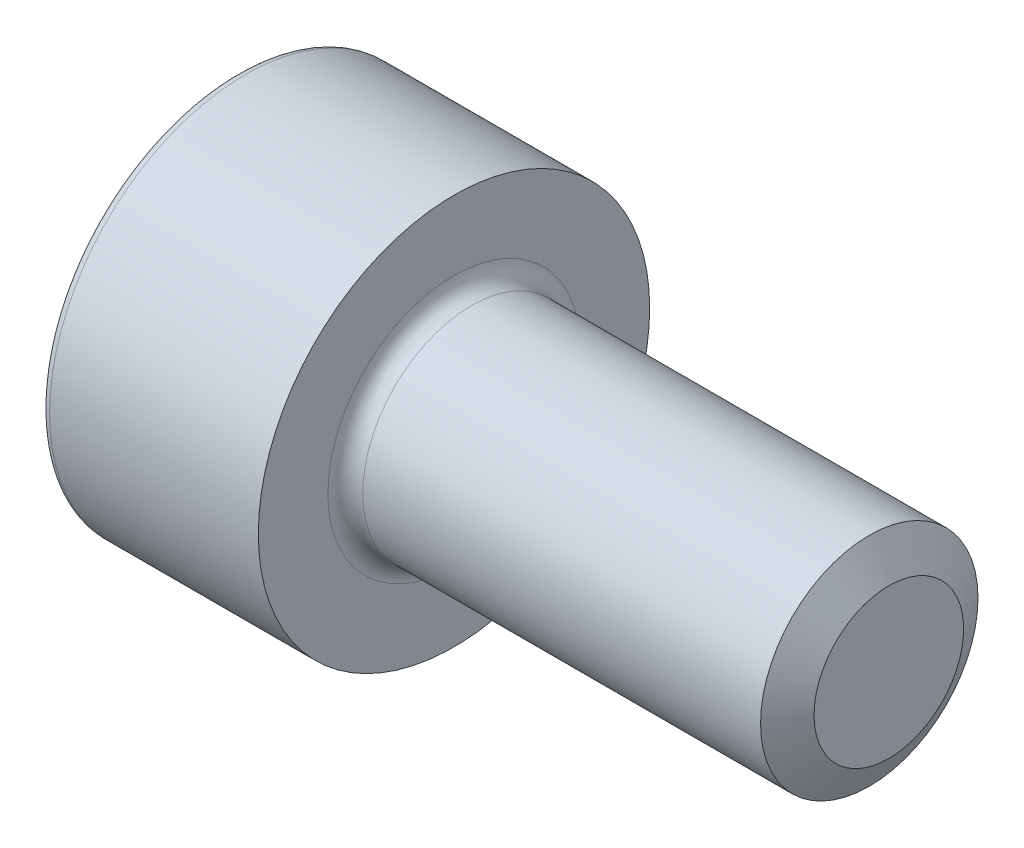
ISO-10303-21;
HEADER;
FILE_DESCRIPTION(('STEP AP214'),'2;1');
FILE_NAME('part.step','',(''),(''),'','','');
FILE_SCHEMA(('AUTOMOTIVE_DESIGN { 1 0 10303 214 1 1 1 1 }'));
ENDSEC;
DATA;
#1=APPLICATION_CONTEXT('core data for automotive mechanical design processes');
#2=APPLICATION_PROTOCOL_DEFINITION('international standard','automotive_design',2000,#1);
#3=PRODUCT_CONTEXT('',#1,'mechanical');
#4=PRODUCT('Part','Part','',(#3));
#5=PRODUCT_RELATED_PRODUCT_CATEGORY('part','',(#4));
#6=PRODUCT_DEFINITION_FORMATION('','',#4);
#7=PRODUCT_DEFINITION_CONTEXT('part definition',#1,'design');
#8=PRODUCT_DEFINITION('design','',#6,#7);
#9=PRODUCT_DEFINITION_SHAPE('','',#8);
#10=(LENGTH_UNIT() NAMED_UNIT(*) SI_UNIT(.MILLI.,.METRE.));
#11=(NAMED_UNIT(*) PLANE_ANGLE_UNIT() SI_UNIT($,.RADIAN.));
#12=(NAMED_UNIT(*) SI_UNIT($,.STERADIAN.) SOLID_ANGLE_UNIT());
#13=UNCERTAINTY_MEASURE_WITH_UNIT(LENGTH_MEASURE(1.E-05),#10,'distance_accuracy_value','');
#14=(GEOMETRIC_REPRESENTATION_CONTEXT(3) GLOBAL_UNCERTAINTY_ASSIGNED_CONTEXT((#13)) GLOBAL_UNIT_ASSIGNED_CONTEXT((#10,
#11,#12)) REPRESENTATION_CONTEXT('',''));
#15=CARTESIAN_POINT('',(0.,0.,0.));
#16=DIRECTION('',(0.,0.,1.));
#17=DIRECTION('',(1.,0.,0.));
#18=AXIS2_PLACEMENT_3D('',#15,#16,#17);
#19=CARTESIAN_POINT('',(7.5,1.25,0.));
#20=DIRECTION('',(-1.,0.,0.));
#21=DIRECTION('',(0.,0.,1.));
#22=AXIS2_PLACEMENT_3D('',#19,#20,#21);
#23=PLANE('',#22);
#24=CARTESIAN_POINT('',(7.5,0.,0.));
#25=DIRECTION('',(-1.,0.,0.));
#26=DIRECTION('',(0.,0.,1.));
#27=AXIS2_PLACEMENT_3D('',#24,#25,#26);
#28=CIRCLE('',#27,0.8603);
#29=CARTESIAN_POINT('',(7.5,0.,0.8603));
#30=VERTEX_POINT('',#29);
#31=EDGE_CURVE('E181',#30,#30,#28,.T.);
#32=ORIENTED_EDGE('',*,*,#31,.F.);
#33=EDGE_LOOP('',(#32));
#34=FACE_BOUND('',#33,.T.);
#35=ADVANCED_FACE('F17',(#34),#23,.F.);
#36=CARTESIAN_POINT('',(1.1,-0.995929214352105,0.575));
#37=DIRECTION('',(1.,0.,0.));
#38=DIRECTION('',(0.,1.,0.));
#39=AXIS2_PLACEMENT_3D('',#36,#37,#38);
#40=PLANE('',#39);
#41=DIRECTION('',(0.,0.866025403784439,0.5));
#42=VECTOR('',#41,1.);
#43=CARTESIAN_POINT('',(1.1,-0.995929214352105,0.575));
#44=LINE('',#43,#42);
#45=CARTESIAN_POINT('',(1.1,-0.995929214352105,0.575));
#46=VERTEX_POINT('',#45);
#47=CARTESIAN_POINT('',(1.1,0.,1.15));
#48=VERTEX_POINT('',#47);
#49=EDGE_CURVE('E142',#46,#48,#44,.T.);
#50=ORIENTED_EDGE('',*,*,#49,.T.);
#51=DIRECTION('',(0.,0.866025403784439,-0.5));
#52=VECTOR('',#51,1.);
#53=CARTESIAN_POINT('',(1.1,0.,1.15));
#54=LINE('',#53,#52);
#55=CARTESIAN_POINT('',(1.1,0.995929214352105,0.575));
#56=VERTEX_POINT('',#55);
#57=EDGE_CURVE('E11',#48,#56,#54,.T.);
#58=ORIENTED_EDGE('',*,*,#57,.T.);
#59=DIRECTION('',(0.,0.,-1.));
#60=VECTOR('',#59,1.);
#61=CARTESIAN_POINT('',(1.1,0.995929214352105,0.575));
#62=LINE('',#61,#60);
#63=CARTESIAN_POINT('',(1.1,0.995929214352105,-0.575));
#64=VERTEX_POINT('',#63);
#65=EDGE_CURVE('E20',#56,#64,#62,.T.);
#66=ORIENTED_EDGE('',*,*,#65,.T.);
#67=DIRECTION('',(0.,-0.866025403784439,-0.5));
#68=VECTOR('',#67,1.);
#69=CARTESIAN_POINT('',(1.1,0.995929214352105,-0.575));
#70=LINE('',#69,#68);
#71=CARTESIAN_POINT('',(1.1,0.,-1.15));
#72=VERTEX_POINT('',#71);
#73=EDGE_CURVE('E155',#64,#72,#70,.T.);
#74=ORIENTED_EDGE('',*,*,#73,.T.);
#75=DIRECTION('',(0.,-0.866025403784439,0.5));
#76=VECTOR('',#75,1.);
#77=CARTESIAN_POINT('',(1.1,0.,-1.15));
#78=LINE('',#77,#76);
#79=CARTESIAN_POINT('',(1.1,-0.995929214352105,-0.575));
#80=VERTEX_POINT('',#79);
#81=EDGE_CURVE('E136',#72,#80,#78,.T.);
#82=ORIENTED_EDGE('',*,*,#81,.T.);
#83=DIRECTION('',(0.,0.,1.));
#84=VECTOR('',#83,1.);
#85=CARTESIAN_POINT('',(1.1,-0.995929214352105,-0.575));
#86=LINE('',#85,#84);
#87=EDGE_CURVE('E149',#80,#46,#86,.T.);
#88=ORIENTED_EDGE('',*,*,#87,.T.);
#89=EDGE_LOOP('',(#50,#58,#66,#74,#82,#88));
#90=FACE_BOUND('',#89,.T.);
#91=ADVANCED_FACE('F211',(#90),#40,.F.);
#92=CARTESIAN_POINT('',(1.1,0.,1.15));
#93=DIRECTION('',(0.,0.5,0.866025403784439));
#94=DIRECTION('',(1.,0.,0.));
#95=AXIS2_PLACEMENT_3D('',#92,#93,#94);
#96=PLANE('',#95);
#97=DIRECTION('',(0.,0.866025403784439,-0.5));
#98=VECTOR('',#97,1.);
#99=CARTESIAN_POINT('',(0.,0.,1.15));
#100=LINE('',#99,#98);
#101=CARTESIAN_POINT('',(0.,0.,1.15));
#102=VERTEX_POINT('',#101);
#103=CARTESIAN_POINT('',(0.,0.995929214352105,0.575));
#104=VERTEX_POINT('',#103);
#105=EDGE_CURVE('E101',#102,#104,#100,.T.);
#106=ORIENTED_EDGE('',*,*,#105,.T.);
#107=DIRECTION('',(-1.,0.,0.));
#108=VECTOR('',#107,1.);
#109=CARTESIAN_POINT('',(1.1,0.995929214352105,0.575));
#110=LINE('',#109,#108);
#111=EDGE_CURVE('E26',#56,#104,#110,.T.);
#112=ORIENTED_EDGE('',*,*,#111,.F.);
#113=ORIENTED_EDGE('',*,*,#57,.F.);
#114=DIRECTION('',(-1.,0.,0.));
#115=VECTOR('',#114,1.);
#116=CARTESIAN_POINT('',(1.1,0.,1.15));
#117=LINE('',#116,#115);
#118=EDGE_CURVE('E106',#48,#102,#117,.T.);
#119=ORIENTED_EDGE('',*,*,#118,.T.);
#120=EDGE_LOOP('',(#106,#112,#113,#119));
#121=FACE_BOUND('',#120,.T.);
#122=ADVANCED_FACE('F108',(#121),#96,.F.);
#123=CARTESIAN_POINT('',(1.1,0.995929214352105,0.575));
#124=DIRECTION('',(0.,1.,0.));
#125=DIRECTION('',(0.,0.,-1.));
#126=AXIS2_PLACEMENT_3D('',#123,#124,#125);
#127=PLANE('',#126);
#128=DIRECTION('',(0.,0.,-1.));
#129=VECTOR('',#128,1.);
#130=CARTESIAN_POINT('',(0.,0.995929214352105,0.575));
#131=LINE('',#130,#129);
#132=CARTESIAN_POINT('',(0.,0.995929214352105,-0.575));
#133=VERTEX_POINT('',#132);
#134=EDGE_CURVE('E90',#104,#133,#131,.T.);
#135=ORIENTED_EDGE('',*,*,#134,.T.);
#136=DIRECTION('',(-1.,0.,0.));
#137=VECTOR('',#136,1.);
#138=CARTESIAN_POINT('',(1.1,0.995929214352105,-0.575));
#139=LINE('',#138,#137);
#140=EDGE_CURVE('E156',#64,#133,#139,.T.);
#141=ORIENTED_EDGE('',*,*,#140,.F.);
#142=ORIENTED_EDGE('',*,*,#65,.F.);
#143=ORIENTED_EDGE('',*,*,#111,.T.);
#144=EDGE_LOOP('',(#135,#141,#142,#143));
#145=FACE_BOUND('',#144,.T.);
#146=ADVANCED_FACE('F89',(#145),#127,.F.);
#147=CARTESIAN_POINT('',(1.1,0.995929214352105,-0.575));
#148=DIRECTION('',(0.,0.5,-0.866025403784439));
#149=DIRECTION('',(-1.,0.,0.));
#150=AXIS2_PLACEMENT_3D('',#147,#148,#149);
#151=PLANE('',#150);
#152=DIRECTION('',(0.,-0.866025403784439,-0.5));
#153=VECTOR('',#152,1.);
#154=CARTESIAN_POINT('',(0.,0.995929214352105,-0.575));
#155=LINE('',#154,#153);
#156=CARTESIAN_POINT('',(0.,0.,-1.15));
#157=VERTEX_POINT('',#156);
#158=EDGE_CURVE('E104',#133,#157,#155,.T.);
#159=ORIENTED_EDGE('',*,*,#158,.T.);
#160=DIRECTION('',(-1.,0.,0.));
#161=VECTOR('',#160,1.);
#162=CARTESIAN_POINT('',(1.1,0.,-1.15));
#163=LINE('',#162,#161);
#164=EDGE_CURVE('E139',#72,#157,#163,.T.);
#165=ORIENTED_EDGE('',*,*,#164,.F.);
#166=ORIENTED_EDGE('',*,*,#73,.F.);
#167=ORIENTED_EDGE('',*,*,#140,.T.);
#168=EDGE_LOOP('',(#159,#165,#166,#167));
#169=FACE_BOUND('',#168,.T.);
#170=ADVANCED_FACE('F223',(#169),#151,.F.);
#171=CARTESIAN_POINT('',(1.1,0.,-1.15));
#172=DIRECTION('',(0.,-0.5,-0.866025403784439));
#173=DIRECTION('',(0.,-0.866025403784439,0.5));
#174=AXIS2_PLACEMENT_3D('',#171,#172,#173);
#175=PLANE('',#174);
#176=DIRECTION('',(0.,-0.866025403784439,0.5));
#177=VECTOR('',#176,1.);
#178=CARTESIAN_POINT('',(0.,0.,-1.15));
#179=LINE('',#178,#177);
#180=CARTESIAN_POINT('',(0.,-0.995929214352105,-0.575));
#181=VERTEX_POINT('',#180);
#182=EDGE_CURVE('E130',#157,#181,#179,.T.);
#183=ORIENTED_EDGE('',*,*,#182,.T.);
#184=DIRECTION('',(-1.,0.,0.));
#185=VECTOR('',#184,1.);
#186=CARTESIAN_POINT('',(1.1,-0.995929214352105,-0.575));
#187=LINE('',#186,#185);
#188=EDGE_CURVE('E140',#80,#181,#187,.T.);
#189=ORIENTED_EDGE('',*,*,#188,.F.);
#190=ORIENTED_EDGE('',*,*,#81,.F.);
#191=ORIENTED_EDGE('',*,*,#164,.T.);
#192=EDGE_LOOP('',(#183,#189,#190,#191));
#193=FACE_BOUND('',#192,.T.);
#194=ADVANCED_FACE('F224',(#193),#175,.F.);
#195=CARTESIAN_POINT('',(1.1,-0.995929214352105,-0.575));
#196=DIRECTION('',(0.,-1.,0.));
#197=DIRECTION('',(0.,0.,-1.));
#198=AXIS2_PLACEMENT_3D('',#195,#196,#197);
#199=PLANE('',#198);
#200=DIRECTION('',(0.,0.,1.));
#201=VECTOR('',#200,1.);
#202=CARTESIAN_POINT('',(0.,-0.995929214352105,-0.575));
#203=LINE('',#202,#201);
#204=CARTESIAN_POINT('',(0.,-0.995929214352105,0.575));
#205=VERTEX_POINT('',#204);
#206=EDGE_CURVE('E120',#181,#205,#203,.T.);
#207=ORIENTED_EDGE('',*,*,#206,.T.);
#208=DIRECTION('',(-1.,0.,0.));
#209=VECTOR('',#208,1.);
#210=CARTESIAN_POINT('',(1.1,-0.995929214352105,0.575));
#211=LINE('',#210,#209);
#212=EDGE_CURVE('E146',#46,#205,#211,.T.);
#213=ORIENTED_EDGE('',*,*,#212,.F.);
#214=ORIENTED_EDGE('',*,*,#87,.F.);
#215=ORIENTED_EDGE('',*,*,#188,.T.);
#216=EDGE_LOOP('',(#207,#213,#214,#215));
#217=FACE_BOUND('',#216,.T.);
#218=ADVANCED_FACE('F227',(#217),#199,.F.);
#219=CARTESIAN_POINT('',(1.1,-0.995929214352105,0.575));
#220=DIRECTION('',(0.,-0.5,0.866025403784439));
#221=DIRECTION('',(-1.,0.,0.));
#222=AXIS2_PLACEMENT_3D('',#219,#220,#221);
#223=PLANE('',#222);
#224=DIRECTION('',(0.,0.866025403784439,0.5));
#225=VECTOR('',#224,1.);
#226=CARTESIAN_POINT('',(0.,-0.995929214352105,0.575));
#227=LINE('',#226,#225);
#228=EDGE_CURVE('E112',#205,#102,#227,.T.);
#229=ORIENTED_EDGE('',*,*,#228,.T.);
#230=ORIENTED_EDGE('',*,*,#118,.F.);
#231=ORIENTED_EDGE('',*,*,#49,.F.);
#232=ORIENTED_EDGE('',*,*,#212,.T.);
#233=EDGE_LOOP('',(#229,#230,#231,#232));
#234=FACE_BOUND('',#233,.T.);
#235=ADVANCED_FACE('F229',(#234),#223,.F.);
#236=CARTESIAN_POINT('',(2.5,2.25,0.));
#237=DIRECTION('',(-1.,0.,0.));
#238=DIRECTION('',(0.,0.,1.));
#239=AXIS2_PLACEMENT_3D('',#236,#237,#238);
#240=PLANE('',#239);
#241=CARTESIAN_POINT('',(2.5,0.,0.));
#242=DIRECTION('',(-1.,0.,0.));
#243=DIRECTION('',(0.,0.,1.));
#244=AXIS2_PLACEMENT_3D('',#241,#242,#243);
#245=CIRCLE('',#244,1.45);
#246=CARTESIAN_POINT('',(2.5,0.,1.45));
#247=VERTEX_POINT('',#246);
#248=EDGE_CURVE('E172',#247,#247,#245,.T.);
#249=ORIENTED_EDGE('',*,*,#248,.T.);
#250=EDGE_LOOP('',(#249));
#251=FACE_BOUND('',#250,.T.);
#252=CARTESIAN_POINT('',(2.5,0.,0.));
#253=DIRECTION('',(-1.,0.,0.));
#254=DIRECTION('',(0.,0.,1.));
#255=AXIS2_PLACEMENT_3D('',#252,#253,#254);
#256=CIRCLE('',#255,2.25);
#257=CARTESIAN_POINT('',(2.5,0.,2.25));
#258=VERTEX_POINT('',#257);
#259=EDGE_CURVE('E113',#258,#258,#256,.T.);
#260=ORIENTED_EDGE('',*,*,#259,.F.);
#261=EDGE_LOOP('',(#260));
#262=FACE_BOUND('',#261,.T.);
#263=ADVANCED_FACE('F232',(#251,#262),#240,.F.);
#264=CARTESIAN_POINT('',(0.,0.,0.));
#265=DIRECTION('',(1.,0.,0.));
#266=DIRECTION('',(0.,1.,0.));
#267=AXIS2_PLACEMENT_3D('',#264,#265,#266);
#268=PLANE('',#267);
#269=ORIENTED_EDGE('',*,*,#105,.F.);
#270=ORIENTED_EDGE('',*,*,#228,.F.);
#271=ORIENTED_EDGE('',*,*,#206,.F.);
#272=ORIENTED_EDGE('',*,*,#182,.F.);
#273=ORIENTED_EDGE('',*,*,#158,.F.);
#274=ORIENTED_EDGE('',*,*,#134,.F.);
#275=EDGE_LOOP('',(#269,#270,#271,#272,#273,#274));
#276=FACE_BOUND('',#275,.T.);
#277=CARTESIAN_POINT('',(0.,0.,0.));
#278=DIRECTION('',(-1.,0.,0.));
#279=DIRECTION('',(0.,0.,-1.));
#280=AXIS2_PLACEMENT_3D('',#277,#278,#279);
#281=CIRCLE('',#280,2.15);
#282=CARTESIAN_POINT('',(0.,0.,-2.15));
#283=VERTEX_POINT('',#282);
#284=EDGE_CURVE('E170',#283,#283,#281,.T.);
#285=ORIENTED_EDGE('',*,*,#284,.T.);
#286=EDGE_LOOP('',(#285));
#287=FACE_BOUND('',#286,.T.);
#288=ADVANCED_FACE('F98',(#276,#287),#268,.F.);
#289=CARTESIAN_POINT('',(0.,0.,0.));
#290=DIRECTION('',(-1.,0.,0.));
#291=DIRECTION('',(0.,0.,1.));
#292=AXIS2_PLACEMENT_3D('',#289,#290,#291);
#293=CYLINDRICAL_SURFACE('',#292,1.25);
#294=CARTESIAN_POINT('',(2.7,0.,0.));
#295=DIRECTION('',(-1.,0.,0.));
#296=DIRECTION('',(0.,0.,1.));
#297=AXIS2_PLACEMENT_3D('',#294,#295,#296);
#298=CIRCLE('',#297,1.25);
#299=CARTESIAN_POINT('',(2.7,0.,1.25));
#300=VERTEX_POINT('',#299);
#301=EDGE_CURVE('E124',#300,#300,#298,.T.);
#302=ORIENTED_EDGE('',*,*,#301,.F.);
#303=EDGE_LOOP('',(#302));
#304=FACE_BOUND('',#303,.T.);
#305=CARTESIAN_POINT('',(7.2750066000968,0.,0.));
#306=DIRECTION('',(-1.,0.,0.));
#307=DIRECTION('',(0.,0.,1.));
#308=AXIS2_PLACEMENT_3D('',#305,#306,#307);
#309=CIRCLE('',#308,1.25);
#310=CARTESIAN_POINT('',(7.2750066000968,0.,1.25));
#311=VERTEX_POINT('',#310);
#312=EDGE_CURVE('E176',#311,#311,#309,.T.);
#313=ORIENTED_EDGE('',*,*,#312,.T.);
#314=EDGE_LOOP('',(#313));
#315=FACE_BOUND('',#314,.T.);
#316=ADVANCED_FACE('F196',(#304,#315),#293,.T.);
#317=CARTESIAN_POINT('',(0.,0.,0.));
#318=DIRECTION('',(-1.,0.,0.));
#319=DIRECTION('',(0.,0.,1.));
#320=AXIS2_PLACEMENT_3D('',#317,#318,#319);
#321=CYLINDRICAL_SURFACE('',#320,2.25);
#322=CARTESIAN_POINT('',(0.1,0.,0.));
#323=DIRECTION('',(1.,0.,0.));
#324=DIRECTION('',(0.,0.,-1.));
#325=AXIS2_PLACEMENT_3D('',#322,#323,#324);
#326=CIRCLE('',#325,2.25);
#327=CARTESIAN_POINT('',(0.1,0.,-2.25));
#328=VERTEX_POINT('',#327);
#329=EDGE_CURVE('E177',#328,#328,#326,.T.);
#330=ORIENTED_EDGE('',*,*,#329,.T.);
#331=EDGE_LOOP('',(#330));
#332=FACE_BOUND('',#331,.T.);
#333=ORIENTED_EDGE('',*,*,#259,.T.);
#334=EDGE_LOOP('',(#333));
#335=FACE_BOUND('',#334,.T.);
#336=ADVANCED_FACE('F199',(#332,#335),#321,.T.);
#337=CARTESIAN_POINT('',(2.7,0.,0.));
#338=DIRECTION('',(-1.,0.,0.));
#339=DIRECTION('',(0.,0.,1.));
#340=AXIS2_PLACEMENT_3D('',#337,#338,#339);
#341=TOROIDAL_SURFACE('',#340,1.45,0.2);
#342=ORIENTED_EDGE('',*,*,#301,.T.);
#343=EDGE_LOOP('',(#342));
#344=FACE_BOUND('',#343,.T.);
#345=ORIENTED_EDGE('',*,*,#248,.F.);
#346=EDGE_LOOP('',(#345));
#347=FACE_BOUND('',#346,.T.);
#348=ADVANCED_FACE('F193',(#344,#347),#341,.F.);
#349=CARTESIAN_POINT('',(7.2750066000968,0.,0.));
#350=DIRECTION('',(-1.,0.,0.));
#351=DIRECTION('',(0.,0.,1.));
#352=AXIS2_PLACEMENT_3D('',#349,#350,#351);
#353=CONICAL_SURFACE('',#352,1.25,1.0471975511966);
#354=ORIENTED_EDGE('',*,*,#312,.F.);
#355=EDGE_LOOP('',(#354));
#356=FACE_BOUND('',#355,.T.);
#357=ORIENTED_EDGE('',*,*,#31,.T.);
#358=EDGE_LOOP('',(#357));
#359=FACE_BOUND('',#358,.T.);
#360=ADVANCED_FACE('F203',(#356,#359),#353,.T.);
#361=CARTESIAN_POINT('',(0.1,0.,0.));
#362=DIRECTION('',(1.,0.,0.));
#363=DIRECTION('',(0.,0.,-1.));
#364=AXIS2_PLACEMENT_3D('',#361,#362,#363);
#365=TOROIDAL_SURFACE('',#364,2.15,0.1);
#366=ORIENTED_EDGE('',*,*,#329,.F.);
#367=EDGE_LOOP('',(#366));
#368=FACE_BOUND('',#367,.T.);
#369=ORIENTED_EDGE('',*,*,#284,.F.);
#370=EDGE_LOOP('',(#369));
#371=FACE_BOUND('',#370,.T.);
#372=ADVANCED_FACE('F206',(#368,#371),#365,.T.);
#373=CLOSED_SHELL('',(#35,#91,#122,#146,#170,#194,#218,#235,#263,#288,#316,#336,#348,#360,#372));
#374=MANIFOLD_SOLID_BREP('B1',#373);
#375=ADVANCED_BREP_SHAPE_REPRESENTATION('',(#18,#374),#14);
#376=SHAPE_DEFINITION_REPRESENTATION(#9,#375);
ENDSEC;
END-ISO-10303-21;
